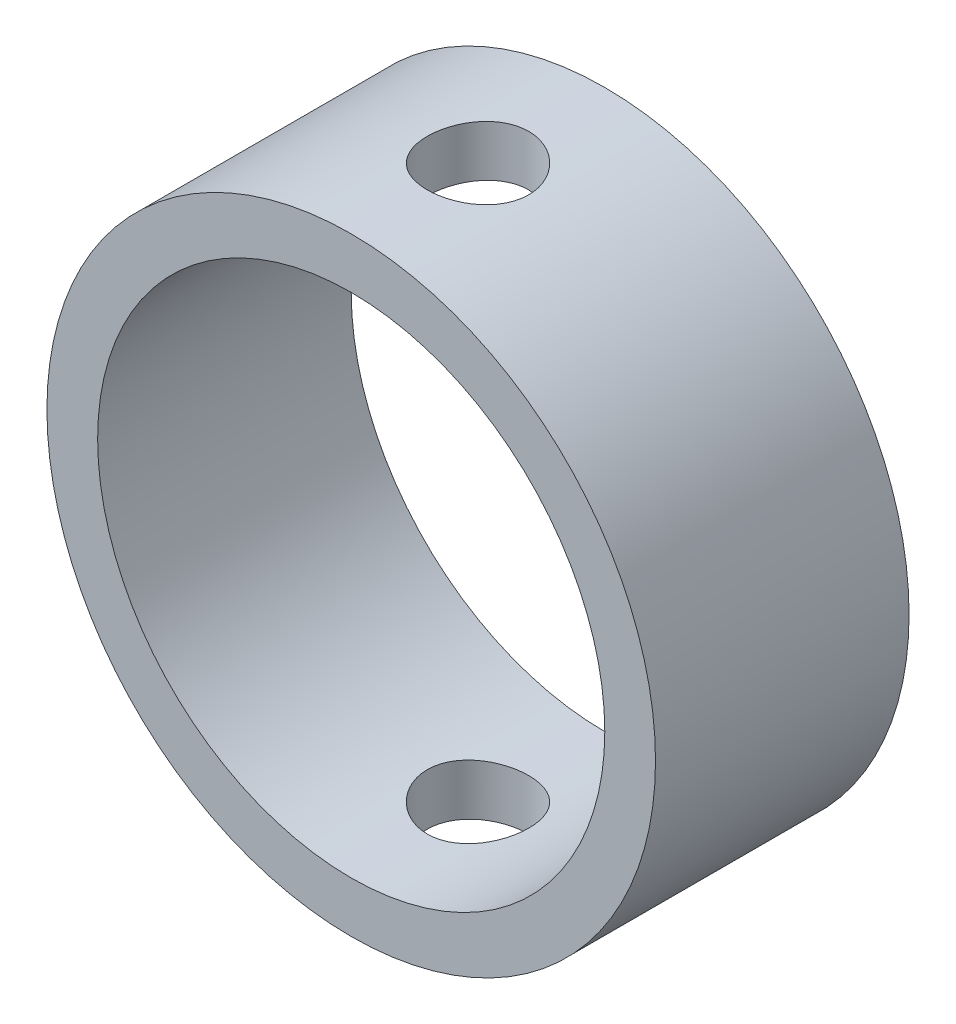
from build123d import *

# Parameters (mm, degrees)
SKIZZE1_R                            = 6
LINEAR_AUSTRAGEN1_DEPTH              = 5
SKIZZE2_R                            = 5
SCHNITT_LINEAR_AUSTRAGEN1_DEPTH      = 5
SCHNITT_LINEAR_AUSTRAGEN2_DEPTH      = 60
SCHNITT_LINEAR_AUSTRAGEN2_DEPTH_BACK = 10
SKIZZE3_R                            = 1


with BuildPart() as part:
    # Skizze1 → Linear austragen1 (new body)
    with BuildSketch(Plane.XY):
        Circle(SKIZZE1_R)
    extrude(amount=LINEAR_AUSTRAGEN1_DEPTH)

    # Skizze2 → Schnitt-Linear austragen1 (cut)
    with BuildSketch(Plane.XY.offset(5)):
        Circle(SKIZZE2_R)
    extrude(amount=-SCHNITT_LINEAR_AUSTRAGEN1_DEPTH, mode=Mode.SUBTRACT)

    # Skizze3 → Schnitt-Linear austragen2 (cut, two sides: drawn at the far end of the back side and taken through both)
    with BuildSketch(Plane(origin=(0, 0, 0), x_dir=(1, 0, 0), z_dir=(0, 1, 0)).offset(-SCHNITT_LINEAR_AUSTRAGEN2_DEPTH_BACK)):
        with Locations(Location((0, -2.5, 0), (0, 0, 270))):
            Circle(SKIZZE3_R)
    extrude(amount=SCHNITT_LINEAR_AUSTRAGEN2_DEPTH + SCHNITT_LINEAR_AUSTRAGEN2_DEPTH_BACK, mode=Mode.SUBTRACT)


solid = part.part
